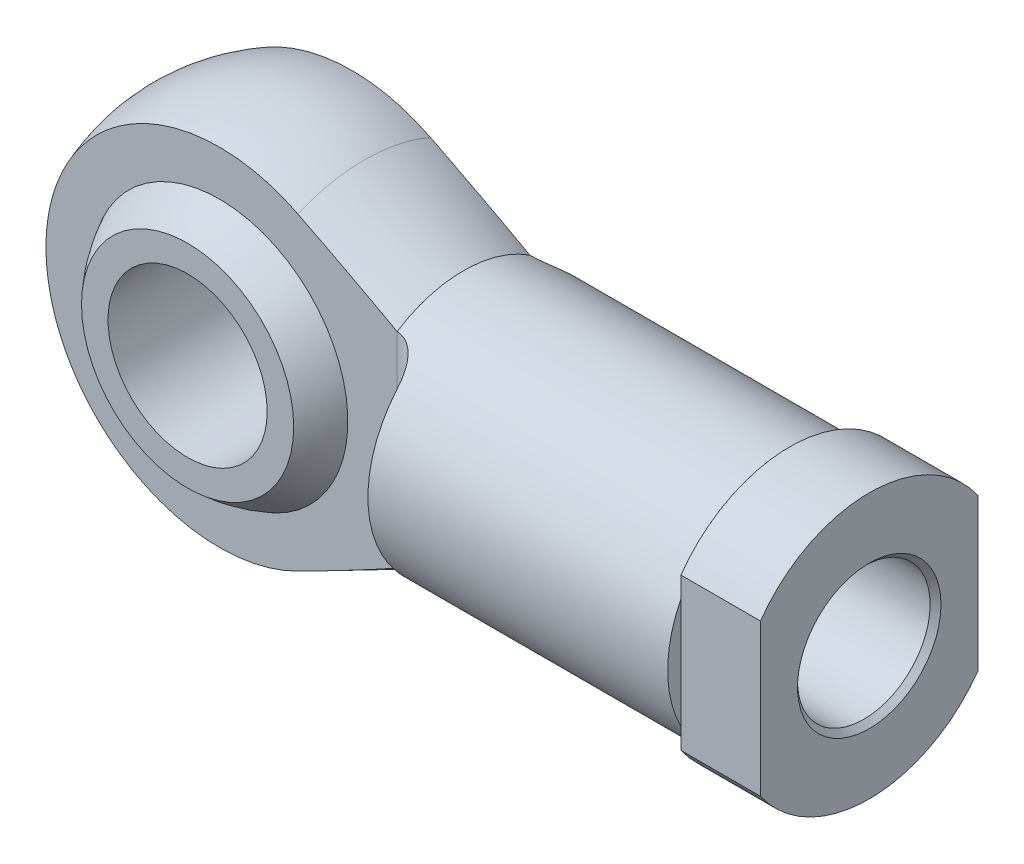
from build123d import *

# Parameters (mm, degrees)
CUT_EXTRUDE_1_DEPTH  = 100
SKETCH_8_OUTSIDE_W   = 85.72
SKETCH_8_OUTSIDE_H   = 105.72
SKETCH_8_OUTSIDE_W_2 = 41
SKETCH_8_OUTSIDE_H_2 = 70
CUT_EXTRUDE_3_DEPTH  = 15
SKETCH_12_R          = 15
CUT_EXTRUDE_4_DEPTH  = 25


with BuildPart() as part:
    # Sketch 1 → Revolve 1 (revolve)
    with BuildSketch(Plane.XY):
        with BuildLine():
            Line((0, 0), (0, 25))
            Line((0, 25), (-15, 25))
            Line((-15, 25), (-15, 23))
            Line((-15, 23), (-76.506603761, 23))
            Line((-76.506603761, 23), (-95.208360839, 31.720772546))
            ThreePointArc((-95.208360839, 31.720772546), (-128.805486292, 29.518700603), (-145, 0))
            Line((-145, 0), (0, 0))
        make_face()
    revolve(axis=Axis((0, 0, 0), (-1, 0, 0)))

    # Sketch 3 → Cut-Extrude 1 (cut, symmetric)
    with BuildSketch(Plane(origin=(0, 30, 0), x_dir=(1, 0, 0), z_dir=(0, 1, 0))):
        with BuildLine():
            Line((-145, -12.5), (-145, 12.5))
            Line((-145, 12.5), (-76.506603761, 12.5))
            ThreePointArc((-76.506603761, 12.5), (-72.971069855, 13.964466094), (-71.506603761, 17.5))
            Line((-71.506603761, 17.5), (-71.506603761, 40))
            Line((-71.506603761, 40), (-151.506603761, 40))
            Line((-151.506603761, 40), (-151.506603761, -40))
            Line((-151.506603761, -40), (-71.506603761, -40))
            Line((-71.506603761, -40), (-71.506603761, -17.5))
            ThreePointArc((-71.506603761, -17.5), (-72.971069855, -13.964466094), (-76.506603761, -12.5))
            Line((-76.506603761, -12.5), (-145, -12.5))
        make_face()
    extrude(amount=CUT_EXTRUDE_1_DEPTH, both=True, mode=Mode.SUBTRACT)

    # Sketch 11 → Cut-Revolve 1 (revolve, cut)
    with BuildSketch(Plane(origin=(0, 0, 0), x_dir=(1, 0, 0), z_dir=(0, 1, 0))):
        with BuildLine():
            Line((-130, 18.5), (-110, 18.5))
            Line((-110, 18.5), (-110, -18.5))
            Line((-110, -18.5), (-130, -18.5))
            ThreePointArc((-130, -18.5), (-137.244265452, 0), (-130, 18.5))
        make_face()
    revolve(axis=Axis((-110, 0, -18.5), (0, 0, 1)), mode=Mode.SUBTRACT)

    # Sketch 8 outside → Cut-Extrude 3 (cut)
    with BuildSketch(Plane(origin=(0, 0, 0), x_dir=(0, 0, -1), z_dir=(1, 0, 0))):
        Rectangle(SKETCH_8_OUTSIDE_W, SKETCH_8_OUTSIDE_H)
        Rectangle(SKETCH_8_OUTSIDE_W_2, SKETCH_8_OUTSIDE_H_2, mode=Mode.SUBTRACT)
    extrude(amount=-CUT_EXTRUDE_3_DEPTH, mode=Mode.SUBTRACT)

    # Sketch 9 → Hole Wizard 1 (revolve, cut)
    with BuildSketch(Plane(origin=(0, 0, 0), x_dir=(0, 0, -1), z_dir=(0, 1, 0))):
        Polygon((0, 0), (0, 67.510757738), (12.5, 60), (12.5, 1.025), (13.525, 0), align=None)
    revolve(axis=Axis((6.35, 0, 0), (-1, 0, 0)), mode=Mode.SUBTRACT)


with BuildPart() as body_2:
    # Sketch 11_2 → Revolve 2 (revolve)
    with BuildSketch(Plane(origin=(0, 0, 0), x_dir=(1, 0, 0), z_dir=(0, 1, 0))):
        with BuildLine():
            Line((-130, 18.5), (-110, 18.5))
            Line((-110, 18.5), (-110, -18.5))
            Line((-110, -18.5), (-130, -18.5))
            ThreePointArc((-130, -18.5), (-137.244265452, 0), (-130, 18.5))
        make_face()
    revolve(axis=Axis((-110, 0, -18.5), (0, 0, 1)))

    # Sketch 12 → Cut-Extrude 4 (cut, symmetric)
    with BuildSketch(Plane.XY):
        with Locations((-110, 0)):
            Circle(SKETCH_12_R)
    extrude(amount=CUT_EXTRUDE_4_DEPTH, both=True, mode=Mode.SUBTRACT)


solid = Compound([part.part, body_2.part])
